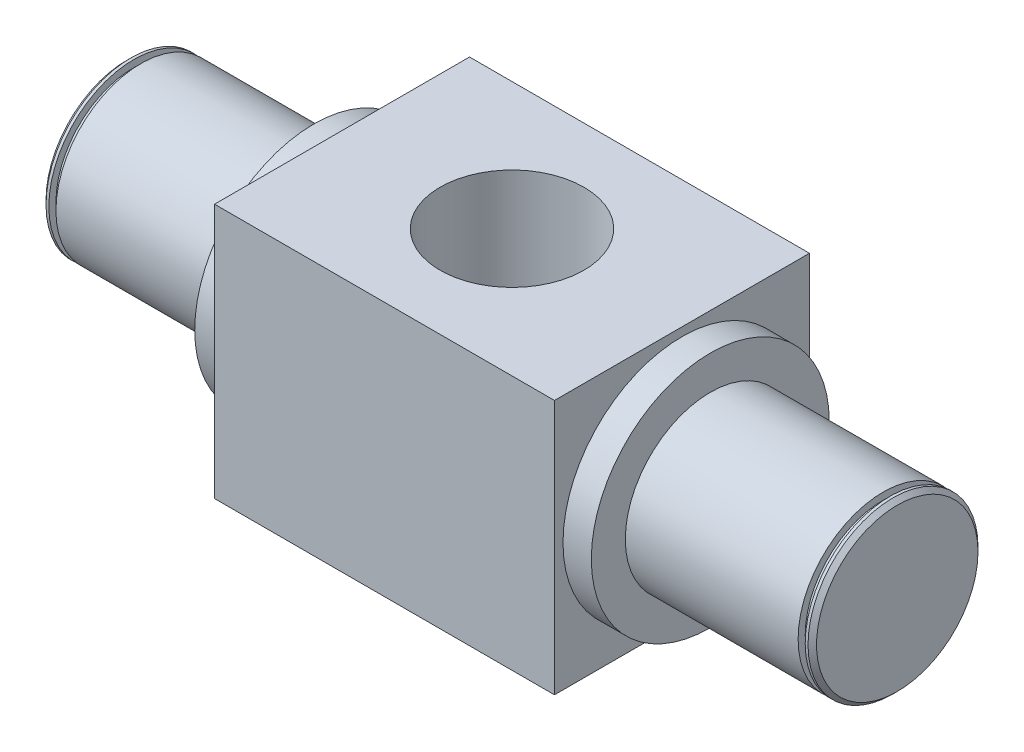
ISO-10303-21;
HEADER;
FILE_DESCRIPTION(('STEP AP214'),'2;1');
FILE_NAME('part.step','',(''),(''),'','','');
FILE_SCHEMA(('AUTOMOTIVE_DESIGN { 1 0 10303 214 1 1 1 1 }'));
ENDSEC;
DATA;
#1=APPLICATION_CONTEXT('core data for automotive mechanical design processes');
#2=APPLICATION_PROTOCOL_DEFINITION('international standard','automotive_design',2000,#1);
#3=PRODUCT_CONTEXT('',#1,'mechanical');
#4=PRODUCT('Part','Part','',(#3));
#5=PRODUCT_RELATED_PRODUCT_CATEGORY('part','',(#4));
#6=PRODUCT_DEFINITION_FORMATION('','',#4);
#7=PRODUCT_DEFINITION_CONTEXT('part definition',#1,'design');
#8=PRODUCT_DEFINITION('design','',#6,#7);
#9=PRODUCT_DEFINITION_SHAPE('','',#8);
#10=(LENGTH_UNIT() NAMED_UNIT(*) SI_UNIT(.MILLI.,.METRE.));
#11=(NAMED_UNIT(*) PLANE_ANGLE_UNIT() SI_UNIT($,.RADIAN.));
#12=(NAMED_UNIT(*) SI_UNIT($,.STERADIAN.) SOLID_ANGLE_UNIT());
#13=UNCERTAINTY_MEASURE_WITH_UNIT(LENGTH_MEASURE(1.E-05),#10,'distance_accuracy_value','');
#14=(GEOMETRIC_REPRESENTATION_CONTEXT(3) GLOBAL_UNCERTAINTY_ASSIGNED_CONTEXT((#13)) GLOBAL_UNIT_ASSIGNED_CONTEXT((#10,
#11,#12)) REPRESENTATION_CONTEXT('',''));
#15=CARTESIAN_POINT('',(0.,0.,0.));
#16=DIRECTION('',(0.,0.,1.));
#17=DIRECTION('',(1.,0.,0.));
#18=AXIS2_PLACEMENT_3D('',#15,#16,#17);
#19=CARTESIAN_POINT('',(68.,22.5,0.));
#20=DIRECTION('',(-1.,0.,0.));
#21=DIRECTION('',(0.,0.,1.));
#22=AXIS2_PLACEMENT_3D('',#19,#20,#21);
#23=CYLINDRICAL_SURFACE('',#22,15.);
#24=CARTESIAN_POINT('',(35.,22.5,0.));
#25=DIRECTION('',(1.,0.,0.));
#26=DIRECTION('',(0.,0.,-1.));
#27=AXIS2_PLACEMENT_3D('',#24,#25,#26);
#28=CIRCLE('',#27,15.);
#29=CARTESIAN_POINT('',(35.,22.5,-15.));
#30=VERTEX_POINT('',#29);
#31=EDGE_CURVE('E120',#30,#30,#28,.T.);
#32=ORIENTED_EDGE('',*,*,#31,.T.);
#33=EDGE_LOOP('',(#32));
#34=FACE_BOUND('',#33,.T.);
#35=CARTESIAN_POINT('',(65.5,22.5,0.));
#36=DIRECTION('',(-1.,0.,0.));
#37=DIRECTION('',(0.,0.,1.));
#38=AXIS2_PLACEMENT_3D('',#35,#36,#37);
#39=CIRCLE('',#38,15.);
#40=CARTESIAN_POINT('',(65.5,22.5,15.));
#41=VERTEX_POINT('',#40);
#42=EDGE_CURVE('E234',#41,#41,#39,.T.);
#43=ORIENTED_EDGE('',*,*,#42,.T.);
#44=EDGE_LOOP('',(#43));
#45=FACE_BOUND('',#44,.T.);
#46=ADVANCED_FACE('F39',(#34,#45),#23,.T.);
#47=CARTESIAN_POINT('',(-68.,22.5,0.));
#48=DIRECTION('',(1.,0.,0.));
#49=DIRECTION('',(0.,0.,-1.));
#50=AXIS2_PLACEMENT_3D('',#47,#48,#49);
#51=CYLINDRICAL_SURFACE('',#50,15.);
#52=CARTESIAN_POINT('',(-35.,22.5,0.));
#53=DIRECTION('',(-1.,0.,0.));
#54=DIRECTION('',(0.,0.,1.));
#55=AXIS2_PLACEMENT_3D('',#52,#53,#54);
#56=CIRCLE('',#55,15.);
#57=CARTESIAN_POINT('',(-35.,22.5,15.));
#58=VERTEX_POINT('',#57);
#59=EDGE_CURVE('E128',#58,#58,#56,.T.);
#60=ORIENTED_EDGE('',*,*,#59,.T.);
#61=EDGE_LOOP('',(#60));
#62=FACE_BOUND('',#61,.T.);
#63=CARTESIAN_POINT('',(-65.5,22.5,0.));
#64=DIRECTION('',(-1.,0.,0.));
#65=DIRECTION('',(0.,0.,1.));
#66=AXIS2_PLACEMENT_3D('',#63,#64,#65);
#67=CIRCLE('',#66,15.);
#68=CARTESIAN_POINT('',(-65.5,22.5,15.));
#69=VERTEX_POINT('',#68);
#70=EDGE_CURVE('E246',#69,#69,#67,.T.);
#71=ORIENTED_EDGE('',*,*,#70,.F.);
#72=EDGE_LOOP('',(#71));
#73=FACE_BOUND('',#72,.T.);
#74=ADVANCED_FACE('F154',(#62,#73),#51,.T.);
#75=CARTESIAN_POINT('',(0.,45.,0.));
#76=DIRECTION('',(0.,1.,0.));
#77=DIRECTION('',(0.,0.,1.));
#78=AXIS2_PLACEMENT_3D('',#75,#76,#77);
#79=PLANE('',#78);
#80=DIRECTION('',(0.,0.,-1.));
#81=VECTOR('',#80,1.);
#82=CARTESIAN_POINT('',(30.,45.,-22.5));
#83=LINE('',#82,#81);
#84=CARTESIAN_POINT('',(30.,45.,22.5));
#85=VERTEX_POINT('',#84);
#86=CARTESIAN_POINT('',(30.,45.,-22.5));
#87=VERTEX_POINT('',#86);
#88=EDGE_CURVE('E94',#85,#87,#83,.T.);
#89=ORIENTED_EDGE('',*,*,#88,.T.);
#90=DIRECTION('',(-1.,0.,0.));
#91=VECTOR('',#90,1.);
#92=CARTESIAN_POINT('',(-30.,45.,-22.5));
#93=LINE('',#92,#91);
#94=CARTESIAN_POINT('',(-30.,45.,-22.5));
#95=VERTEX_POINT('',#94);
#96=EDGE_CURVE('E88',#87,#95,#93,.T.);
#97=ORIENTED_EDGE('',*,*,#96,.T.);
#98=DIRECTION('',(0.,0.,1.));
#99=VECTOR('',#98,1.);
#100=CARTESIAN_POINT('',(-30.,45.,-22.5));
#101=LINE('',#100,#99);
#102=CARTESIAN_POINT('',(-30.,45.,22.5));
#103=VERTEX_POINT('',#102);
#104=EDGE_CURVE('E92',#95,#103,#101,.T.);
#105=ORIENTED_EDGE('',*,*,#104,.T.);
#106=DIRECTION('',(1.,0.,0.));
#107=VECTOR('',#106,1.);
#108=CARTESIAN_POINT('',(-30.,45.,22.5));
#109=LINE('',#108,#107);
#110=EDGE_CURVE('E57',#103,#85,#109,.T.);
#111=ORIENTED_EDGE('',*,*,#110,.T.);
#112=EDGE_LOOP('',(#89,#97,#105,#111));
#113=FACE_BOUND('',#112,.T.);
#114=CARTESIAN_POINT('',(0.,45.,0.));
#115=DIRECTION('',(0.,1.,0.));
#116=DIRECTION('',(0.,0.,1.));
#117=AXIS2_PLACEMENT_3D('',#114,#115,#116);
#118=CIRCLE('',#117,12.7);
#119=CARTESIAN_POINT('',(0.,45.,-12.7));
#120=VERTEX_POINT('',#119);
#121=EDGE_CURVE('E112',#120,#120,#118,.T.);
#122=ORIENTED_EDGE('',*,*,#121,.F.);
#123=EDGE_LOOP('',(#122));
#124=FACE_BOUND('',#123,.T.);
#125=ADVANCED_FACE('F89',(#113,#124),#79,.T.);
#126=CARTESIAN_POINT('',(0.,0.,0.));
#127=DIRECTION('',(0.,1.,0.));
#128=DIRECTION('',(0.,0.,1.));
#129=AXIS2_PLACEMENT_3D('',#126,#127,#128);
#130=PLANE('',#129);
#131=DIRECTION('',(0.,0.,-1.));
#132=VECTOR('',#131,1.);
#133=CARTESIAN_POINT('',(30.,0.,-22.5));
#134=LINE('',#133,#132);
#135=CARTESIAN_POINT('',(30.,0.,22.5));
#136=VERTEX_POINT('',#135);
#137=CARTESIAN_POINT('',(30.,0.,-22.5));
#138=VERTEX_POINT('',#137);
#139=EDGE_CURVE('E109',#136,#138,#134,.T.);
#140=ORIENTED_EDGE('',*,*,#139,.F.);
#141=DIRECTION('',(1.,0.,0.));
#142=VECTOR('',#141,1.);
#143=CARTESIAN_POINT('',(-30.,0.,22.5));
#144=LINE('',#143,#142);
#145=CARTESIAN_POINT('',(-30.,0.,22.5));
#146=VERTEX_POINT('',#145);
#147=EDGE_CURVE('E80',#146,#136,#144,.T.);
#148=ORIENTED_EDGE('',*,*,#147,.F.);
#149=DIRECTION('',(0.,0.,1.));
#150=VECTOR('',#149,1.);
#151=CARTESIAN_POINT('',(-30.,0.,-22.5));
#152=LINE('',#151,#150);
#153=CARTESIAN_POINT('',(-30.,0.,-22.5));
#154=VERTEX_POINT('',#153);
#155=EDGE_CURVE('E74',#154,#146,#152,.T.);
#156=ORIENTED_EDGE('',*,*,#155,.F.);
#157=DIRECTION('',(-1.,0.,0.));
#158=VECTOR('',#157,1.);
#159=CARTESIAN_POINT('',(-30.,0.,-22.5));
#160=LINE('',#159,#158);
#161=EDGE_CURVE('E99',#138,#154,#160,.T.);
#162=ORIENTED_EDGE('',*,*,#161,.F.);
#163=EDGE_LOOP('',(#140,#148,#156,#162));
#164=FACE_BOUND('',#163,.T.);
#165=CARTESIAN_POINT('',(0.,0.,0.));
#166=DIRECTION('',(0.,1.,0.));
#167=DIRECTION('',(0.,0.,1.));
#168=AXIS2_PLACEMENT_3D('',#165,#166,#167);
#169=CIRCLE('',#168,12.7);
#170=CARTESIAN_POINT('',(0.,0.,-12.7));
#171=VERTEX_POINT('',#170);
#172=EDGE_CURVE('E123',#171,#171,#169,.T.);
#173=ORIENTED_EDGE('',*,*,#172,.T.);
#174=EDGE_LOOP('',(#173));
#175=FACE_BOUND('',#174,.T.);
#176=ADVANCED_FACE('F262',(#164,#175),#130,.F.);
#177=CARTESIAN_POINT('',(30.,45.,-22.5));
#178=DIRECTION('',(-1.,0.,0.));
#179=DIRECTION('',(0.,0.,1.));
#180=AXIS2_PLACEMENT_3D('',#177,#178,#179);
#181=PLANE('',#180);
#182=CARTESIAN_POINT('',(30.,22.5,0.));
#183=DIRECTION('',(-1.,0.,0.));
#184=DIRECTION('',(0.,0.,1.));
#185=AXIS2_PLACEMENT_3D('',#182,#183,#184);
#186=CIRCLE('',#185,21.);
#187=CARTESIAN_POINT('',(30.,22.5,21.));
#188=VERTEX_POINT('',#187);
#189=EDGE_CURVE('E119',#188,#188,#186,.F.);
#190=ORIENTED_EDGE('',*,*,#189,.F.);
#191=EDGE_LOOP('',(#190));
#192=FACE_BOUND('',#191,.T.);
#193=ORIENTED_EDGE('',*,*,#139,.T.);
#194=DIRECTION('',(0.,-1.,0.));
#195=VECTOR('',#194,1.);
#196=CARTESIAN_POINT('',(30.,45.,-22.5));
#197=LINE('',#196,#195);
#198=EDGE_CURVE('E100',#87,#138,#197,.T.);
#199=ORIENTED_EDGE('',*,*,#198,.F.);
#200=ORIENTED_EDGE('',*,*,#88,.F.);
#201=DIRECTION('',(0.,-1.,0.));
#202=VECTOR('',#201,1.);
#203=CARTESIAN_POINT('',(30.,45.,22.5));
#204=LINE('',#203,#202);
#205=EDGE_CURVE('E105',#85,#136,#204,.T.);
#206=ORIENTED_EDGE('',*,*,#205,.T.);
#207=EDGE_LOOP('',(#193,#199,#200,#206));
#208=FACE_BOUND('',#207,.T.);
#209=ADVANCED_FACE('F275',(#192,#208),#181,.F.);
#210=CARTESIAN_POINT('',(-30.,45.,-22.5));
#211=DIRECTION('',(0.,0.,1.));
#212=DIRECTION('',(1.,0.,0.));
#213=AXIS2_PLACEMENT_3D('',#210,#211,#212);
#214=PLANE('',#213);
#215=ORIENTED_EDGE('',*,*,#161,.T.);
#216=DIRECTION('',(0.,-1.,0.));
#217=VECTOR('',#216,1.);
#218=CARTESIAN_POINT('',(-30.,45.,-22.5));
#219=LINE('',#218,#217);
#220=EDGE_CURVE('E97',#95,#154,#219,.T.);
#221=ORIENTED_EDGE('',*,*,#220,.F.);
#222=ORIENTED_EDGE('',*,*,#96,.F.);
#223=ORIENTED_EDGE('',*,*,#198,.T.);
#224=EDGE_LOOP('',(#215,#221,#222,#223));
#225=FACE_BOUND('',#224,.T.);
#226=ADVANCED_FACE('F98',(#225),#214,.F.);
#227=CARTESIAN_POINT('',(-30.,45.,-22.5));
#228=DIRECTION('',(1.,0.,0.));
#229=DIRECTION('',(0.,0.,-1.));
#230=AXIS2_PLACEMENT_3D('',#227,#228,#229);
#231=PLANE('',#230);
#232=CARTESIAN_POINT('',(-30.,22.5,0.));
#233=DIRECTION('',(1.,0.,0.));
#234=DIRECTION('',(0.,0.,-1.));
#235=AXIS2_PLACEMENT_3D('',#232,#233,#234);
#236=CIRCLE('',#235,21.);
#237=CARTESIAN_POINT('',(-30.,22.5,-21.));
#238=VERTEX_POINT('',#237);
#239=EDGE_CURVE('E127',#238,#238,#236,.F.);
#240=ORIENTED_EDGE('',*,*,#239,.F.);
#241=EDGE_LOOP('',(#240));
#242=FACE_BOUND('',#241,.T.);
#243=ORIENTED_EDGE('',*,*,#155,.T.);
#244=DIRECTION('',(0.,-1.,0.));
#245=VECTOR('',#244,1.);
#246=CARTESIAN_POINT('',(-30.,45.,22.5));
#247=LINE('',#246,#245);
#248=EDGE_CURVE('E101',#103,#146,#247,.T.);
#249=ORIENTED_EDGE('',*,*,#248,.F.);
#250=ORIENTED_EDGE('',*,*,#104,.F.);
#251=ORIENTED_EDGE('',*,*,#220,.T.);
#252=EDGE_LOOP('',(#243,#249,#250,#251));
#253=FACE_BOUND('',#252,.T.);
#254=ADVANCED_FACE('F103',(#242,#253),#231,.F.);
#255=CARTESIAN_POINT('',(-30.,45.,22.5));
#256=DIRECTION('',(0.,0.,-1.));
#257=DIRECTION('',(-1.,0.,0.));
#258=AXIS2_PLACEMENT_3D('',#255,#256,#257);
#259=PLANE('',#258);
#260=ORIENTED_EDGE('',*,*,#147,.T.);
#261=ORIENTED_EDGE('',*,*,#205,.F.);
#262=ORIENTED_EDGE('',*,*,#110,.F.);
#263=ORIENTED_EDGE('',*,*,#248,.T.);
#264=EDGE_LOOP('',(#260,#261,#262,#263));
#265=FACE_BOUND('',#264,.T.);
#266=ADVANCED_FACE('F265',(#265),#259,.F.);
#267=CARTESIAN_POINT('',(0.,45.,0.));
#268=DIRECTION('',(0.,-1.,0.));
#269=DIRECTION('',(0.,0.,-1.));
#270=AXIS2_PLACEMENT_3D('',#267,#268,#269);
#271=CYLINDRICAL_SURFACE('',#270,12.7);
#272=CARTESIAN_POINT('',(0.,45.,-12.7));
#273=CARTESIAN_POINT('',(0.,44.53125,-12.7));
#274=CARTESIAN_POINT('',(0.,44.0625,-12.7));
#275=CARTESIAN_POINT('',(0.,43.125,-12.7));
#276=CARTESIAN_POINT('',(0.,42.65625,-12.7));
#277=CARTESIAN_POINT('',(0.,41.71875,-12.7));
#278=CARTESIAN_POINT('',(0.,41.25,-12.7));
#279=CARTESIAN_POINT('',(0.,40.3125,-12.7));
#280=CARTESIAN_POINT('',(0.,39.84375,-12.7));
#281=CARTESIAN_POINT('',(0.,38.90625,-12.7));
#282=CARTESIAN_POINT('',(0.,38.4375,-12.7));
#283=CARTESIAN_POINT('',(0.,37.5,-12.7));
#284=CARTESIAN_POINT('',(0.,37.03125,-12.7));
#285=CARTESIAN_POINT('',(0.,36.09375,-12.7));
#286=CARTESIAN_POINT('',(0.,35.625,-12.7));
#287=CARTESIAN_POINT('',(0.,34.6875,-12.7));
#288=CARTESIAN_POINT('',(0.,34.21875,-12.7));
#289=CARTESIAN_POINT('',(0.,33.28125,-12.7));
#290=CARTESIAN_POINT('',(0.,32.8125,-12.7));
#291=CARTESIAN_POINT('',(0.,31.875,-12.7));
#292=CARTESIAN_POINT('',(0.,31.40625,-12.7));
#293=CARTESIAN_POINT('',(0.,30.46875,-12.7));
#294=CARTESIAN_POINT('',(0.,30.,-12.7));
#295=CARTESIAN_POINT('',(0.,29.0625,-12.7));
#296=CARTESIAN_POINT('',(0.,28.59375,-12.7));
#297=CARTESIAN_POINT('',(0.,27.65625,-12.7));
#298=CARTESIAN_POINT('',(0.,27.1875,-12.7));
#299=CARTESIAN_POINT('',(0.,26.25,-12.7));
#300=CARTESIAN_POINT('',(0.,25.78125,-12.7));
#301=CARTESIAN_POINT('',(0.,24.84375,-12.7));
#302=CARTESIAN_POINT('',(0.,24.375,-12.7));
#303=CARTESIAN_POINT('',(0.,23.4375,-12.7));
#304=CARTESIAN_POINT('',(0.,22.96875,-12.7));
#305=CARTESIAN_POINT('',(0.,22.03125,-12.7));
#306=CARTESIAN_POINT('',(0.,21.5625,-12.7));
#307=CARTESIAN_POINT('',(0.,20.625,-12.7));
#308=CARTESIAN_POINT('',(0.,20.15625,-12.7));
#309=CARTESIAN_POINT('',(0.,19.21875,-12.7));
#310=CARTESIAN_POINT('',(0.,18.75,-12.7));
#311=CARTESIAN_POINT('',(0.,17.8125,-12.7));
#312=CARTESIAN_POINT('',(0.,17.34375,-12.7));
#313=CARTESIAN_POINT('',(0.,16.40625,-12.7));
#314=CARTESIAN_POINT('',(0.,15.9375,-12.7));
#315=CARTESIAN_POINT('',(0.,15.,-12.7));
#316=CARTESIAN_POINT('',(0.,14.53125,-12.7));
#317=CARTESIAN_POINT('',(0.,13.59375,-12.7));
#318=CARTESIAN_POINT('',(0.,13.125,-12.7));
#319=CARTESIAN_POINT('',(0.,12.1875,-12.7));
#320=CARTESIAN_POINT('',(0.,11.71875,-12.7));
#321=CARTESIAN_POINT('',(0.,10.78125,-12.7));
#322=CARTESIAN_POINT('',(0.,10.3125,-12.7));
#323=CARTESIAN_POINT('',(0.,9.37499999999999,-12.7));
#324=CARTESIAN_POINT('',(0.,8.90624999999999,-12.7));
#325=CARTESIAN_POINT('',(0.,7.96874999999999,-12.7));
#326=CARTESIAN_POINT('',(0.,7.5,-12.7));
#327=CARTESIAN_POINT('',(0.,6.56249999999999,-12.7));
#328=CARTESIAN_POINT('',(0.,6.09374999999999,-12.7));
#329=CARTESIAN_POINT('',(0.,5.15624999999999,-12.7));
#330=CARTESIAN_POINT('',(0.,4.68749999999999,-12.7));
#331=CARTESIAN_POINT('',(0.,3.74999999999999,-12.7));
#332=CARTESIAN_POINT('',(0.,3.28124999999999,-12.7));
#333=CARTESIAN_POINT('',(0.,2.34374999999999,-12.7));
#334=CARTESIAN_POINT('',(0.,1.87499999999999,-12.7));
#335=CARTESIAN_POINT('',(0.,0.937499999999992,-12.7));
#336=CARTESIAN_POINT('',(0.,0.468749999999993,-12.7));
#337=CARTESIAN_POINT('',(0.,0.,-12.7));
#338=B_SPLINE_CURVE_WITH_KNOTS('',3,(#272,#273,#274,#275,#276,#277,#278,#279,#280,#281,#282,
#283,#284,#285,#286,#287,#288,#289,#290,#291,#292,#293,#294,#295,#296,#297,#298,#299,#300,#301,
#302,#303,#304,#305,#306,#307,#308,#309,#310,#311,#312,#313,#314,#315,#316,#317,#318,#319,#320,
#321,#322,#323,#324,#325,#326,#327,#328,#329,#330,#331,#332,#333,#334,#335,#336,#337),
.UNSPECIFIED.,.F.,.F.,(4,2,2,2,2,2,2,2,2,2,2,2,2,2,2,2,2,2,2,2,2,2,2,2,2,2,2,2,2,2,2,2,4),(0.,
1.40625,2.8125,4.21874999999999,5.625,7.03125,8.43749999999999,9.84375,11.25,12.65625,14.0625,
15.46875,16.875,18.28125,19.6875,21.09375,22.5,23.90625,25.3125,26.71875,28.125,29.53125,
30.9375,32.34375,33.75,35.15625,36.5625,37.96875,39.375,40.78125,42.1875,43.59375,45.),.UNSPECIFIED.);
#339=EDGE_CURVE('BSEAM198',#120,#171,#338,.T.);
#340=ORIENTED_EDGE('',*,*,#121,.T.);
#341=ORIENTED_EDGE('',*,*,#172,.F.);
#342=ORIENTED_EDGE('',*,*,#339,.T.);
#343=ORIENTED_EDGE('',*,*,#339,.F.);
#344=EDGE_LOOP('',(#340,#342,#341,#343));
#345=FACE_BOUND('',#344,.T.);
#346=ADVANCED_FACE('F198',(#345),#271,.F.);
#347=CARTESIAN_POINT('',(35.,22.5,0.));
#348=DIRECTION('',(-1.,0.,0.));
#349=DIRECTION('',(0.,0.,1.));
#350=AXIS2_PLACEMENT_3D('',#347,#348,#349);
#351=CYLINDRICAL_SURFACE('',#350,21.);
#352=CARTESIAN_POINT('',(35.,22.5,0.));
#353=DIRECTION('',(1.,0.,0.));
#354=DIRECTION('',(0.,0.,-1.));
#355=AXIS2_PLACEMENT_3D('',#352,#353,#354);
#356=CIRCLE('',#355,21.);
#357=CARTESIAN_POINT('',(35.,22.5,-21.));
#358=VERTEX_POINT('',#357);
#359=EDGE_CURVE('E124',#358,#358,#356,.T.);
#360=ORIENTED_EDGE('',*,*,#359,.F.);
#361=EDGE_LOOP('',(#360));
#362=FACE_BOUND('',#361,.T.);
#363=ORIENTED_EDGE('',*,*,#189,.T.);
#364=EDGE_LOOP('',(#363));
#365=FACE_BOUND('',#364,.T.);
#366=ADVANCED_FACE('F194',(#362,#365),#351,.T.);
#367=CARTESIAN_POINT('',(35.,22.5,0.));
#368=DIRECTION('',(1.,0.,0.));
#369=DIRECTION('',(0.,0.,-1.));
#370=AXIS2_PLACEMENT_3D('',#367,#368,#369);
#371=PLANE('',#370);
#372=ORIENTED_EDGE('',*,*,#31,.F.);
#373=EDGE_LOOP('',(#372));
#374=FACE_BOUND('',#373,.T.);
#375=ORIENTED_EDGE('',*,*,#359,.T.);
#376=EDGE_LOOP('',(#375));
#377=FACE_BOUND('',#376,.T.);
#378=ADVANCED_FACE('F197',(#374,#377),#371,.T.);
#379=CARTESIAN_POINT('',(-35.,22.5,0.));
#380=DIRECTION('',(1.,0.,0.));
#381=DIRECTION('',(0.,0.,-1.));
#382=AXIS2_PLACEMENT_3D('',#379,#380,#381);
#383=CYLINDRICAL_SURFACE('',#382,21.);
#384=CARTESIAN_POINT('',(-35.,22.5,0.));
#385=DIRECTION('',(-1.,0.,0.));
#386=DIRECTION('',(0.,0.,1.));
#387=AXIS2_PLACEMENT_3D('',#384,#385,#386);
#388=CIRCLE('',#387,21.);
#389=CARTESIAN_POINT('',(-35.,22.5,21.));
#390=VERTEX_POINT('',#389);
#391=EDGE_CURVE('E131',#390,#390,#388,.T.);
#392=ORIENTED_EDGE('',*,*,#391,.F.);
#393=EDGE_LOOP('',(#392));
#394=FACE_BOUND('',#393,.T.);
#395=ORIENTED_EDGE('',*,*,#239,.T.);
#396=EDGE_LOOP('',(#395));
#397=FACE_BOUND('',#396,.T.);
#398=ADVANCED_FACE('F202',(#394,#397),#383,.T.);
#399=CARTESIAN_POINT('',(-35.,22.5,0.));
#400=DIRECTION('',(-1.,0.,0.));
#401=DIRECTION('',(0.,0.,1.));
#402=AXIS2_PLACEMENT_3D('',#399,#400,#401);
#403=PLANE('',#402);
#404=ORIENTED_EDGE('',*,*,#59,.F.);
#405=EDGE_LOOP('',(#404));
#406=FACE_BOUND('',#405,.T.);
#407=ORIENTED_EDGE('',*,*,#391,.T.);
#408=EDGE_LOOP('',(#407));
#409=FACE_BOUND('',#408,.T.);
#410=ADVANCED_FACE('F206',(#406,#409),#403,.T.);
#411=CARTESIAN_POINT('',(-66.75,22.5,0.));
#412=DIRECTION('',(-1.,0.,0.));
#413=DIRECTION('',(0.,0.,1.));
#414=AXIS2_PLACEMENT_3D('',#411,#412,#413);
#415=PLANE('',#414);
#416=CARTESIAN_POINT('',(-66.75,22.5,0.));
#417=DIRECTION('',(-1.,0.,0.));
#418=DIRECTION('',(0.,0.,1.));
#419=AXIS2_PLACEMENT_3D('',#416,#417,#418);
#420=CIRCLE('',#419,15.);
#421=CARTESIAN_POINT('',(-66.75,22.5,15.));
#422=VERTEX_POINT('',#421);
#423=EDGE_CURVE('E248',#422,#422,#420,.T.);
#424=ORIENTED_EDGE('',*,*,#423,.F.);
#425=EDGE_LOOP('',(#424));
#426=FACE_BOUND('',#425,.T.);
#427=CARTESIAN_POINT('',(-66.75,22.5,0.));
#428=DIRECTION('',(-1.,0.,0.));
#429=DIRECTION('',(0.,0.,1.));
#430=AXIS2_PLACEMENT_3D('',#427,#428,#429);
#431=CIRCLE('',#430,13.75);
#432=CARTESIAN_POINT('',(-66.75,22.5,13.75));
#433=VERTEX_POINT('',#432);
#434=EDGE_CURVE('E237',#433,#433,#431,.T.);
#435=ORIENTED_EDGE('',*,*,#434,.T.);
#436=EDGE_LOOP('',(#435));
#437=FACE_BOUND('',#436,.T.);
#438=ADVANCED_FACE('F210',(#426,#437),#415,.F.);
#439=CARTESIAN_POINT('',(-65.5,22.5,0.));
#440=DIRECTION('',(-1.,0.,0.));
#441=DIRECTION('',(0.,0.,1.));
#442=AXIS2_PLACEMENT_3D('',#439,#440,#441);
#443=PLANE('',#442);
#444=ORIENTED_EDGE('',*,*,#70,.T.);
#445=EDGE_LOOP('',(#444));
#446=FACE_BOUND('',#445,.T.);
#447=CARTESIAN_POINT('',(-65.5,22.5,0.));
#448=DIRECTION('',(-1.,0.,0.));
#449=DIRECTION('',(0.,0.,1.));
#450=AXIS2_PLACEMENT_3D('',#447,#448,#449);
#451=CIRCLE('',#450,13.75);
#452=CARTESIAN_POINT('',(-65.5,22.5,13.75));
#453=VERTEX_POINT('',#452);
#454=EDGE_CURVE('E233',#453,#453,#451,.T.);
#455=ORIENTED_EDGE('',*,*,#454,.F.);
#456=EDGE_LOOP('',(#455));
#457=FACE_BOUND('',#456,.T.);
#458=ADVANCED_FACE('F212',(#446,#457),#443,.T.);
#459=CARTESIAN_POINT('',(-66.75,22.5,0.));
#460=DIRECTION('',(1.,0.,0.));
#461=DIRECTION('',(0.,0.,-1.));
#462=AXIS2_PLACEMENT_3D('',#459,#460,#461);
#463=CYLINDRICAL_SURFACE('',#462,13.75);
#464=ORIENTED_EDGE('',*,*,#434,.F.);
#465=EDGE_LOOP('',(#464));
#466=FACE_BOUND('',#465,.T.);
#467=ORIENTED_EDGE('',*,*,#454,.T.);
#468=EDGE_LOOP('',(#467));
#469=FACE_BOUND('',#468,.T.);
#470=ADVANCED_FACE('F155',(#466,#469),#463,.T.);
#471=CARTESIAN_POINT('',(-68.,22.5,0.));
#472=DIRECTION('',(-1.,0.,0.));
#473=DIRECTION('',(0.,0.,1.));
#474=AXIS2_PLACEMENT_3D('',#471,#472,#473);
#475=PLANE('',#474);
#476=CARTESIAN_POINT('',(-68.,22.5,0.));
#477=DIRECTION('',(-1.,0.,0.));
#478=DIRECTION('',(0.,0.,1.));
#479=AXIS2_PLACEMENT_3D('',#476,#477,#478);
#480=CIRCLE('',#479,14.25);
#481=CARTESIAN_POINT('',(-68.,22.5,14.25));
#482=VERTEX_POINT('',#481);
#483=EDGE_CURVE('E49',#482,#482,#480,.T.);
#484=ORIENTED_EDGE('',*,*,#483,.T.);
#485=EDGE_LOOP('',(#484));
#486=FACE_BOUND('',#485,.T.);
#487=ADVANCED_FACE('F142',(#486),#475,.T.);
#488=CARTESIAN_POINT('',(-68.,22.5,0.));
#489=DIRECTION('',(1.,0.,0.));
#490=DIRECTION('',(0.,0.,-1.));
#491=AXIS2_PLACEMENT_3D('',#488,#489,#490);
#492=CONICAL_SURFACE('',#491,14.25,0.785398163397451);
#493=CARTESIAN_POINT('',(-67.25,22.5,0.));
#494=DIRECTION('',(-1.,0.,0.));
#495=DIRECTION('',(0.,0.,1.));
#496=AXIS2_PLACEMENT_3D('',#493,#494,#495);
#497=CIRCLE('',#496,15.);
#498=CARTESIAN_POINT('',(-67.25,22.5,15.));
#499=VERTEX_POINT('',#498);
#500=EDGE_CURVE('E11',#499,#499,#497,.F.);
#501=ORIENTED_EDGE('',*,*,#500,.F.);
#502=EDGE_LOOP('',(#501));
#503=FACE_BOUND('',#502,.T.);
#504=ORIENTED_EDGE('',*,*,#483,.F.);
#505=EDGE_LOOP('',(#504));
#506=FACE_BOUND('',#505,.T.);
#507=ADVANCED_FACE('F42',(#503,#506),#492,.T.);
#508=ORIENTED_EDGE('',*,*,#423,.T.);
#509=EDGE_LOOP('',(#508));
#510=FACE_BOUND('',#509,.T.);
#511=ORIENTED_EDGE('',*,*,#500,.T.);
#512=EDGE_LOOP('',(#511));
#513=FACE_BOUND('',#512,.T.);
#514=ADVANCED_FACE('F145',(#510,#513),#51,.T.);
#515=CARTESIAN_POINT('',(66.75,22.5,0.));
#516=DIRECTION('',(1.,0.,0.));
#517=DIRECTION('',(0.,0.,1.));
#518=AXIS2_PLACEMENT_3D('',#515,#516,#517);
#519=PLANE('',#518);
#520=CARTESIAN_POINT('',(66.75,22.5,0.));
#521=DIRECTION('',(-1.,0.,0.));
#522=DIRECTION('',(0.,0.,1.));
#523=AXIS2_PLACEMENT_3D('',#520,#521,#522);
#524=CIRCLE('',#523,13.75);
#525=CARTESIAN_POINT('',(66.75,22.5,13.75));
#526=VERTEX_POINT('',#525);
#527=EDGE_CURVE('E232',#526,#526,#524,.T.);
#528=ORIENTED_EDGE('',*,*,#527,.F.);
#529=EDGE_LOOP('',(#528));
#530=FACE_BOUND('',#529,.T.);
#531=CARTESIAN_POINT('',(66.75,22.5,0.));
#532=DIRECTION('',(-1.,0.,0.));
#533=DIRECTION('',(0.,0.,1.));
#534=AXIS2_PLACEMENT_3D('',#531,#532,#533);
#535=CIRCLE('',#534,15.);
#536=CARTESIAN_POINT('',(66.75,22.5,15.));
#537=VERTEX_POINT('',#536);
#538=EDGE_CURVE('E180',#537,#537,#535,.T.);
#539=ORIENTED_EDGE('',*,*,#538,.T.);
#540=EDGE_LOOP('',(#539));
#541=FACE_BOUND('',#540,.T.);
#542=ADVANCED_FACE('F151',(#530,#541),#519,.F.);
#543=CARTESIAN_POINT('',(65.5,22.5,0.));
#544=DIRECTION('',(1.,0.,0.));
#545=DIRECTION('',(0.,0.,1.));
#546=AXIS2_PLACEMENT_3D('',#543,#544,#545);
#547=PLANE('',#546);
#548=CARTESIAN_POINT('',(65.5,22.5,0.));
#549=DIRECTION('',(-1.,0.,0.));
#550=DIRECTION('',(0.,0.,1.));
#551=AXIS2_PLACEMENT_3D('',#548,#549,#550);
#552=CIRCLE('',#551,13.75);
#553=CARTESIAN_POINT('',(65.5,22.5,13.75));
#554=VERTEX_POINT('',#553);
#555=EDGE_CURVE('E242',#554,#554,#552,.T.);
#556=ORIENTED_EDGE('',*,*,#555,.T.);
#557=EDGE_LOOP('',(#556));
#558=FACE_BOUND('',#557,.T.);
#559=ORIENTED_EDGE('',*,*,#42,.F.);
#560=EDGE_LOOP('',(#559));
#561=FACE_BOUND('',#560,.T.);
#562=ADVANCED_FACE('F190',(#558,#561),#547,.T.);
#563=CARTESIAN_POINT('',(66.75,22.5,0.));
#564=DIRECTION('',(-1.,0.,0.));
#565=DIRECTION('',(0.,0.,1.));
#566=AXIS2_PLACEMENT_3D('',#563,#564,#565);
#567=CYLINDRICAL_SURFACE('',#566,13.75);
#568=ORIENTED_EDGE('',*,*,#527,.T.);
#569=EDGE_LOOP('',(#568));
#570=FACE_BOUND('',#569,.T.);
#571=ORIENTED_EDGE('',*,*,#555,.F.);
#572=EDGE_LOOP('',(#571));
#573=FACE_BOUND('',#572,.T.);
#574=ADVANCED_FACE('F186',(#570,#573),#567,.T.);
#575=CARTESIAN_POINT('',(68.,22.5,0.));
#576=DIRECTION('',(1.,0.,0.));
#577=DIRECTION('',(0.,0.,-1.));
#578=AXIS2_PLACEMENT_3D('',#575,#576,#577);
#579=PLANE('',#578);
#580=CARTESIAN_POINT('',(68.,22.5,0.));
#581=DIRECTION('',(1.,0.,0.));
#582=DIRECTION('',(0.,0.,-1.));
#583=AXIS2_PLACEMENT_3D('',#580,#581,#582);
#584=CIRCLE('',#583,14.25);
#585=CARTESIAN_POINT('',(68.,22.5,-14.25));
#586=VERTEX_POINT('',#585);
#587=EDGE_CURVE('E134',#586,#586,#584,.T.);
#588=ORIENTED_EDGE('',*,*,#587,.T.);
#589=EDGE_LOOP('',(#588));
#590=FACE_BOUND('',#589,.T.);
#591=ADVANCED_FACE('F175',(#590),#579,.T.);
#592=CARTESIAN_POINT('',(68.,22.5,0.));
#593=DIRECTION('',(-1.,0.,0.));
#594=DIRECTION('',(0.,0.,1.));
#595=AXIS2_PLACEMENT_3D('',#592,#593,#594);
#596=CONICAL_SURFACE('',#595,14.25,0.785398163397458);
#597=CARTESIAN_POINT('',(67.25,22.5,0.));
#598=DIRECTION('',(1.,0.,0.));
#599=DIRECTION('',(0.,0.,-1.));
#600=AXIS2_PLACEMENT_3D('',#597,#598,#599);
#601=CIRCLE('',#600,15.);
#602=CARTESIAN_POINT('',(67.25,22.5,-15.));
#603=VERTEX_POINT('',#602);
#604=EDGE_CURVE('E137',#603,#603,#601,.F.);
#605=ORIENTED_EDGE('',*,*,#604,.F.);
#606=EDGE_LOOP('',(#605));
#607=FACE_BOUND('',#606,.T.);
#608=ORIENTED_EDGE('',*,*,#587,.F.);
#609=EDGE_LOOP('',(#608));
#610=FACE_BOUND('',#609,.T.);
#611=ADVANCED_FACE('F170',(#607,#610),#596,.T.);
#612=ORIENTED_EDGE('',*,*,#538,.F.);
#613=EDGE_LOOP('',(#612));
#614=FACE_BOUND('',#613,.T.);
#615=ORIENTED_EDGE('',*,*,#604,.T.);
#616=EDGE_LOOP('',(#615));
#617=FACE_BOUND('',#616,.T.);
#618=ADVANCED_FACE('F161',(#614,#617),#23,.T.);
#619=CLOSED_SHELL('',(#46,#74,#125,#176,#209,#226,#254,#266,#346,#366,#378,#398,#410,#438,#458,
#470,#487,#507,#514,#542,#562,#574,#591,#611,#618));
#620=MANIFOLD_SOLID_BREP('B2',#619);
#621=ADVANCED_BREP_SHAPE_REPRESENTATION('',(#18,#620),#14);
#622=SHAPE_DEFINITION_REPRESENTATION(#9,#621);
ENDSEC;
END-ISO-10303-21;
